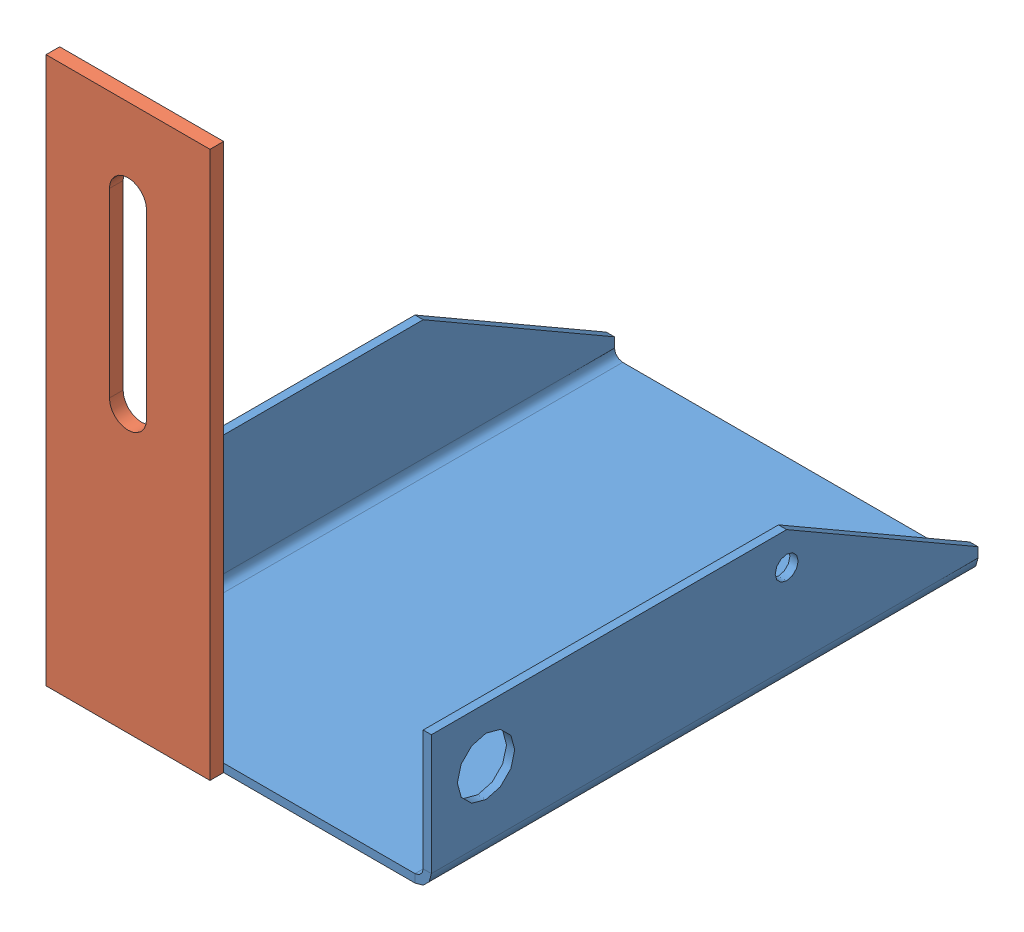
SolidWorks assembly BU030564.sldasm, configuration Défaut (file format 8000). Lengths in mm.
Overall size (68 100 102.5).
2 component instances, 2 part files, 4 mates.
Components (placement in the parent):
- BU030565-1: BU030565.sldprt [Défaut] at (235 5 -75) x (-1 0 0) z (0 1 0) size (68 100 25)
- DC040125-1: DC040125.sldprt [Défaut] at (216 5 25) size (30 100 2.5)
Mates (geometry in assembly coordinates):
- Coïncidente14: coincident aligned: plane of DC040125-1; plane of ?
- Coïncidente31: coincident anti-aligned: plane of BU030565-1; plane of DC040125-1
- Coïncidente32: coincident aligned: plane of BU030565-1; plane of DC040125-1
- Coïncidente33: coincident: line of BU030565-1; plane of DC040125-1
